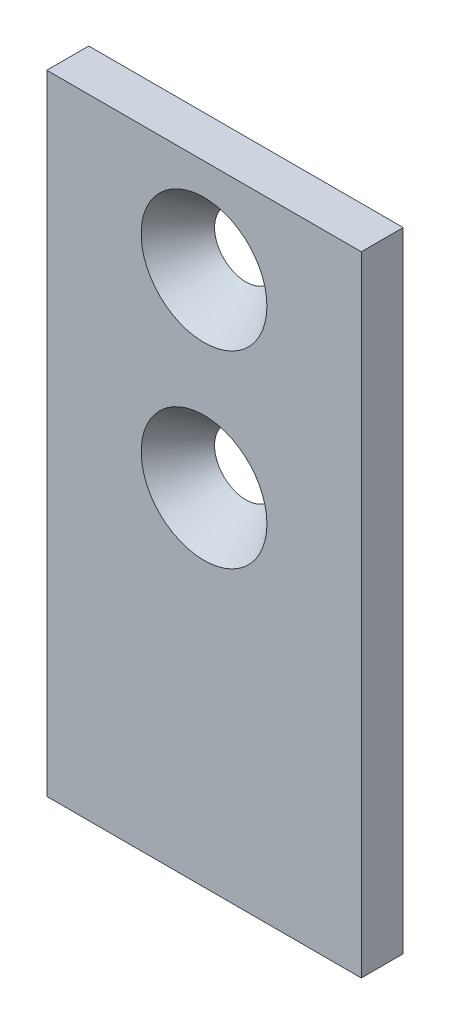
ISO-10303-21;
HEADER;
FILE_DESCRIPTION(('STEP AP214'),'2;1');
FILE_NAME('part.step','',(''),(''),'','','');
FILE_SCHEMA(('AUTOMOTIVE_DESIGN { 1 0 10303 214 1 1 1 1 }'));
ENDSEC;
DATA;
#1=APPLICATION_CONTEXT('core data for automotive mechanical design processes');
#2=APPLICATION_PROTOCOL_DEFINITION('international standard','automotive_design',2000,#1);
#3=PRODUCT_CONTEXT('',#1,'mechanical');
#4=PRODUCT('Part','Part','',(#3));
#5=PRODUCT_RELATED_PRODUCT_CATEGORY('part','',(#4));
#6=PRODUCT_DEFINITION_FORMATION('','',#4);
#7=PRODUCT_DEFINITION_CONTEXT('part definition',#1,'design');
#8=PRODUCT_DEFINITION('design','',#6,#7);
#9=PRODUCT_DEFINITION_SHAPE('','',#8);
#10=(LENGTH_UNIT() NAMED_UNIT(*) SI_UNIT(.MILLI.,.METRE.));
#11=(NAMED_UNIT(*) PLANE_ANGLE_UNIT() SI_UNIT($,.RADIAN.));
#12=(NAMED_UNIT(*) SI_UNIT($,.STERADIAN.) SOLID_ANGLE_UNIT());
#13=UNCERTAINTY_MEASURE_WITH_UNIT(LENGTH_MEASURE(1.E-05),#10,'distance_accuracy_value','');
#14=(GEOMETRIC_REPRESENTATION_CONTEXT(3) GLOBAL_UNCERTAINTY_ASSIGNED_CONTEXT((#13)) GLOBAL_UNIT_ASSIGNED_CONTEXT((#10,
#11,#12)) REPRESENTATION_CONTEXT('',''));
#15=CARTESIAN_POINT('',(0.,0.,0.));
#16=DIRECTION('',(0.,0.,1.));
#17=DIRECTION('',(1.,0.,0.));
#18=AXIS2_PLACEMENT_3D('',#15,#16,#17);
#19=CARTESIAN_POINT('',(11.54999595,52.3691028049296,1.51389569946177));
#20=DIRECTION('',(0.,1.,0.));
#21=DIRECTION('',(0.,0.,1.));
#22=AXIS2_PLACEMENT_3D('',#19,#20,#21);
#23=PLANE('',#22);
#24=DIRECTION('',(-1.,0.,0.));
#25=VECTOR('',#24,1.);
#26=CARTESIAN_POINT('',(19.05,52.3691028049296,1.51389569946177));
#27=LINE('',#26,#25);
#28=CARTESIAN_POINT('',(26.55000405,52.3691028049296,1.51389569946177));
#29=VERTEX_POINT('',#28);
#30=CARTESIAN_POINT('',(11.54999595,52.3691028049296,1.51389569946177));
#31=VERTEX_POINT('',#30);
#32=EDGE_CURVE('E118',#29,#31,#27,.T.);
#33=ORIENTED_EDGE('',*,*,#32,.T.);
#34=DIRECTION('',(0.,0.,-1.));
#35=VECTOR('',#34,1.);
#36=CARTESIAN_POINT('',(11.54999595,52.3691028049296,2.51389623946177));
#37=LINE('',#36,#35);
#38=CARTESIAN_POINT('',(11.54999595,52.3691028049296,3.51389677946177));
#39=VERTEX_POINT('',#38);
#40=EDGE_CURVE('E74',#39,#31,#37,.T.);
#41=ORIENTED_EDGE('',*,*,#40,.F.);
#42=DIRECTION('',(-1.,0.,0.));
#43=VECTOR('',#42,1.);
#44=CARTESIAN_POINT('',(19.05,52.3691028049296,3.51389677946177));
#45=LINE('',#44,#43);
#46=CARTESIAN_POINT('',(26.55000405,52.3691028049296,3.51389677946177));
#47=VERTEX_POINT('',#46);
#48=EDGE_CURVE('E116',#47,#39,#45,.T.);
#49=ORIENTED_EDGE('',*,*,#48,.F.);
#50=DIRECTION('',(0.,0.,1.));
#51=VECTOR('',#50,1.);
#52=CARTESIAN_POINT('',(26.55000405,52.3691028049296,2.51389623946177));
#53=LINE('',#52,#51);
#54=EDGE_CURVE('E96',#29,#47,#53,.T.);
#55=ORIENTED_EDGE('',*,*,#54,.F.);
#56=EDGE_LOOP('',(#33,#41,#49,#55));
#57=FACE_BOUND('',#56,.T.);
#58=ADVANCED_FACE('F34',(#57),#23,.T.);
#59=CARTESIAN_POINT('',(11.54999595,22.3690866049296,1.51389569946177));
#60=DIRECTION('',(-1.,0.,0.));
#61=DIRECTION('',(0.,0.,1.));
#62=AXIS2_PLACEMENT_3D('',#59,#60,#61);
#63=PLANE('',#62);
#64=DIRECTION('',(0.,-1.,0.));
#65=VECTOR('',#64,1.);
#66=CARTESIAN_POINT('',(11.54999595,37.3690947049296,1.51389569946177));
#67=LINE('',#66,#65);
#68=CARTESIAN_POINT('',(11.54999595,22.3690866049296,1.51389569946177));
#69=VERTEX_POINT('',#68);
#70=EDGE_CURVE('E90',#31,#69,#67,.T.);
#71=ORIENTED_EDGE('',*,*,#70,.T.);
#72=DIRECTION('',(0.,0.,-1.));
#73=VECTOR('',#72,1.);
#74=CARTESIAN_POINT('',(11.54999595,22.3690866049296,2.51389623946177));
#75=LINE('',#74,#73);
#76=CARTESIAN_POINT('',(11.54999595,22.3690866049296,3.51389677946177));
#77=VERTEX_POINT('',#76);
#78=EDGE_CURVE('E80',#77,#69,#75,.T.);
#79=ORIENTED_EDGE('',*,*,#78,.F.);
#80=DIRECTION('',(0.,-1.,0.));
#81=VECTOR('',#80,1.);
#82=CARTESIAN_POINT('',(11.54999595,37.3690947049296,3.51389677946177));
#83=LINE('',#82,#81);
#84=EDGE_CURVE('E112',#39,#77,#83,.T.);
#85=ORIENTED_EDGE('',*,*,#84,.F.);
#86=ORIENTED_EDGE('',*,*,#40,.T.);
#87=EDGE_LOOP('',(#71,#79,#85,#86));
#88=FACE_BOUND('',#87,.T.);
#89=ADVANCED_FACE('F95',(#88),#63,.T.);
#90=CARTESIAN_POINT('',(11.54999595,22.3690866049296,3.51389677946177));
#91=DIRECTION('',(0.,-1.,0.));
#92=DIRECTION('',(0.,0.,-1.));
#93=AXIS2_PLACEMENT_3D('',#90,#91,#92);
#94=PLANE('',#93);
#95=DIRECTION('',(1.,0.,0.));
#96=VECTOR('',#95,1.);
#97=CARTESIAN_POINT('',(19.05,22.3690866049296,3.51389677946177));
#98=LINE('',#97,#96);
#99=CARTESIAN_POINT('',(26.55000405,22.3690866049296,3.51389677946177));
#100=VERTEX_POINT('',#99);
#101=EDGE_CURVE('E53',#77,#100,#98,.T.);
#102=ORIENTED_EDGE('',*,*,#101,.F.);
#103=ORIENTED_EDGE('',*,*,#78,.T.);
#104=DIRECTION('',(1.,0.,0.));
#105=VECTOR('',#104,1.);
#106=CARTESIAN_POINT('',(19.05,22.3690866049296,1.51389569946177));
#107=LINE('',#106,#105);
#108=CARTESIAN_POINT('',(26.55000405,22.3690866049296,1.51389569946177));
#109=VERTEX_POINT('',#108);
#110=EDGE_CURVE('E83',#69,#109,#107,.T.);
#111=ORIENTED_EDGE('',*,*,#110,.T.);
#112=DIRECTION('',(0.,0.,-1.));
#113=VECTOR('',#112,1.);
#114=CARTESIAN_POINT('',(26.55000405,22.3690866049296,2.51389623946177));
#115=LINE('',#114,#113);
#116=EDGE_CURVE('E84',#100,#109,#115,.T.);
#117=ORIENTED_EDGE('',*,*,#116,.F.);
#118=EDGE_LOOP('',(#102,#103,#111,#117));
#119=FACE_BOUND('',#118,.T.);
#120=ADVANCED_FACE('F82',(#119),#94,.T.);
#121=CARTESIAN_POINT('',(26.55000405,22.3690866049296,3.51389677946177));
#122=DIRECTION('',(1.,0.,0.));
#123=DIRECTION('',(0.,0.,-1.));
#124=AXIS2_PLACEMENT_3D('',#121,#122,#123);
#125=PLANE('',#124);
#126=DIRECTION('',(0.,1.,0.));
#127=VECTOR('',#126,1.);
#128=CARTESIAN_POINT('',(26.55000405,37.3690947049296,1.51389569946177));
#129=LINE('',#128,#127);
#130=EDGE_CURVE('E93',#109,#29,#129,.T.);
#131=ORIENTED_EDGE('',*,*,#130,.T.);
#132=ORIENTED_EDGE('',*,*,#54,.T.);
#133=DIRECTION('',(0.,1.,0.));
#134=VECTOR('',#133,1.);
#135=CARTESIAN_POINT('',(26.55000405,37.3690947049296,3.51389677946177));
#136=LINE('',#135,#134);
#137=EDGE_CURVE('E106',#100,#47,#136,.T.);
#138=ORIENTED_EDGE('',*,*,#137,.F.);
#139=ORIENTED_EDGE('',*,*,#116,.T.);
#140=EDGE_LOOP('',(#131,#132,#138,#139));
#141=FACE_BOUND('',#140,.T.);
#142=ADVANCED_FACE('F120',(#141),#125,.T.);
#143=CARTESIAN_POINT('',(19.05,47.8691003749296,1.51389569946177));
#144=DIRECTION('',(0.,0.,1.));
#145=DIRECTION('',(1.,0.,0.));
#146=AXIS2_PLACEMENT_3D('',#143,#144,#145);
#147=CONICAL_SURFACE('',#146,1.50000081,0.643501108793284);
#148=CARTESIAN_POINT('',(19.05,47.8691003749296,3.5138967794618));
#149=DIRECTION('',(0.,0.,1.));
#150=DIRECTION('',(1.,0.,0.));
#151=AXIS2_PLACEMENT_3D('',#148,#149,#150);
#152=CIRCLE('',#151,3.00000162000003);
#153=CARTESIAN_POINT('',(22.05000162,47.8691003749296,3.5138967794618));
#154=VERTEX_POINT('',#153);
#155=EDGE_CURVE('E104',#154,#154,#152,.F.);
#156=ORIENTED_EDGE('',*,*,#155,.F.);
#157=EDGE_LOOP('',(#156));
#158=FACE_BOUND('',#157,.T.);
#159=CARTESIAN_POINT('',(19.05,47.8691003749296,1.51389569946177));
#160=DIRECTION('',(0.,0.,1.));
#161=DIRECTION('',(1.,0.,0.));
#162=AXIS2_PLACEMENT_3D('',#159,#160,#161);
#163=CIRCLE('',#162,1.50000081);
#164=CARTESIAN_POINT('',(20.55000081,47.8691003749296,1.51389569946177));
#165=VERTEX_POINT('',#164);
#166=EDGE_CURVE('E38',#165,#165,#163,.F.);
#167=ORIENTED_EDGE('',*,*,#166,.T.);
#168=EDGE_LOOP('',(#167));
#169=FACE_BOUND('',#168,.T.);
#170=ADVANCED_FACE('F130',(#158,#169),#147,.F.);
#171=CARTESIAN_POINT('',(11.54999595,22.3690866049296,1.51389569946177));
#172=DIRECTION('',(0.,0.,1.));
#173=DIRECTION('',(1.,0.,0.));
#174=AXIS2_PLACEMENT_3D('',#171,#172,#173);
#175=PLANE('',#174);
#176=CARTESIAN_POINT('',(19.05,38.8690955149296,1.51389569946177));
#177=DIRECTION('',(0.,0.,1.));
#178=DIRECTION('',(1.,0.,0.));
#179=AXIS2_PLACEMENT_3D('',#176,#177,#178);
#180=CIRCLE('',#179,1.50000081);
#181=CARTESIAN_POINT('',(20.55000081,38.8690955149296,1.51389569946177));
#182=VERTEX_POINT('',#181);
#183=EDGE_CURVE('E44',#182,#182,#180,.F.);
#184=ORIENTED_EDGE('',*,*,#183,.F.);
#185=EDGE_LOOP('',(#184));
#186=FACE_BOUND('',#185,.T.);
#187=ORIENTED_EDGE('',*,*,#166,.F.);
#188=EDGE_LOOP('',(#187));
#189=FACE_BOUND('',#188,.T.);
#190=ORIENTED_EDGE('',*,*,#130,.F.);
#191=ORIENTED_EDGE('',*,*,#110,.F.);
#192=ORIENTED_EDGE('',*,*,#70,.F.);
#193=ORIENTED_EDGE('',*,*,#32,.F.);
#194=EDGE_LOOP('',(#190,#191,#192,#193));
#195=FACE_BOUND('',#194,.T.);
#196=ADVANCED_FACE('F88',(#186,#189,#195),#175,.F.);
#197=CARTESIAN_POINT('',(11.54999595,22.3690866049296,3.51389677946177));
#198=DIRECTION('',(0.,0.,1.));
#199=DIRECTION('',(1.,0.,0.));
#200=AXIS2_PLACEMENT_3D('',#197,#198,#199);
#201=PLANE('',#200);
#202=ORIENTED_EDGE('',*,*,#155,.T.);
#203=EDGE_LOOP('',(#202));
#204=FACE_BOUND('',#203,.T.);
#205=CARTESIAN_POINT('',(19.05,38.8690955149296,3.5138967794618));
#206=DIRECTION('',(0.,0.,1.));
#207=DIRECTION('',(1.,0.,0.));
#208=AXIS2_PLACEMENT_3D('',#205,#206,#207);
#209=CIRCLE('',#208,3.00000162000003);
#210=CARTESIAN_POINT('',(22.05000162,38.8690955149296,3.5138967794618));
#211=VERTEX_POINT('',#210);
#212=EDGE_CURVE('E11',#211,#211,#209,.T.);
#213=ORIENTED_EDGE('',*,*,#212,.F.);
#214=EDGE_LOOP('',(#213));
#215=FACE_BOUND('',#214,.T.);
#216=ORIENTED_EDGE('',*,*,#101,.T.);
#217=ORIENTED_EDGE('',*,*,#137,.T.);
#218=ORIENTED_EDGE('',*,*,#48,.T.);
#219=ORIENTED_EDGE('',*,*,#84,.T.);
#220=EDGE_LOOP('',(#216,#217,#218,#219));
#221=FACE_BOUND('',#220,.T.);
#222=ADVANCED_FACE('F36',(#204,#215,#221),#201,.T.);
#223=CARTESIAN_POINT('',(19.05,38.8690955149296,1.51389569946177));
#224=DIRECTION('',(0.,0.,1.));
#225=DIRECTION('',(1.,0.,0.));
#226=AXIS2_PLACEMENT_3D('',#223,#224,#225);
#227=CONICAL_SURFACE('',#226,1.50000081,0.643501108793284);
#228=ORIENTED_EDGE('',*,*,#212,.T.);
#229=EDGE_LOOP('',(#228));
#230=FACE_BOUND('',#229,.T.);
#231=ORIENTED_EDGE('',*,*,#183,.T.);
#232=EDGE_LOOP('',(#231));
#233=FACE_BOUND('',#232,.T.);
#234=ADVANCED_FACE('F123',(#230,#233),#227,.F.);
#235=CLOSED_SHELL('',(#58,#89,#120,#142,#170,#196,#222,#234));
#236=MANIFOLD_SOLID_BREP('B2',#235);
#237=ADVANCED_BREP_SHAPE_REPRESENTATION('',(#18,#236),#14);
#238=SHAPE_DEFINITION_REPRESENTATION(#9,#237);
ENDSEC;
END-ISO-10303-21;
